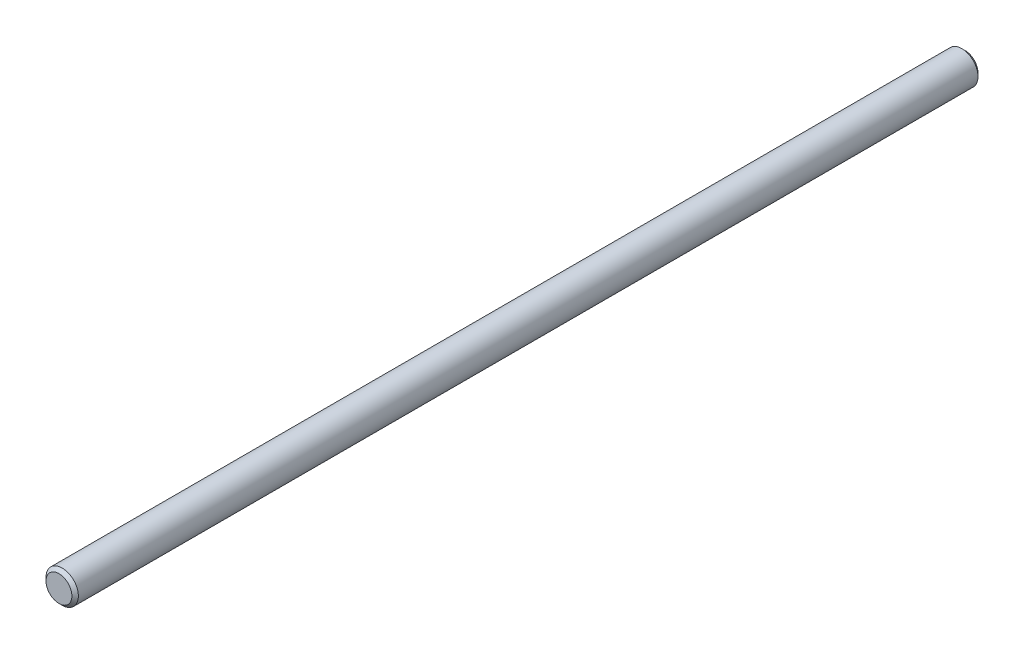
from build123d import *

# Parameters (mm, degrees)
ESQUISSE1_R          = 1
BASE_EXTRUSION_DEPTH = 56
CHANFREIN1_SIZE      = 0.2


with BuildPart() as part:
    # Esquisse1 → Base-Extrusion (new body)
    with BuildSketch(Plane.XY):
        Circle(ESQUISSE1_R)
    extrude(amount=BASE_EXTRUSION_DEPTH)

    # Chanfrein1
    chanfrein1_edges = [part.edges().sort_by_distance(p)[0] for p in [
        (-1, 0, 0),
        (-1, 0, 56),
    ]]
    chamfer(chanfrein1_edges, length=CHANFREIN1_SIZE)


solid = part.part
